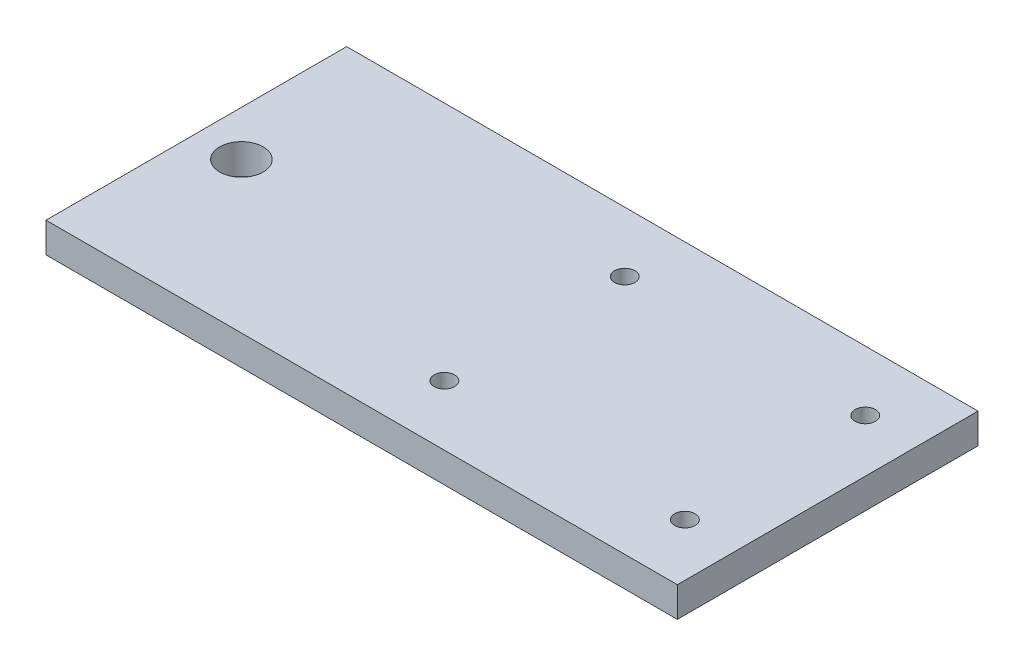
from build123d import *

# Parameters (mm, degrees)
ESQUISSE1_W             = 100
ESQUISSE1_H             = 10
EXTRUSION1_DEPTH        = 105
ESQUISSE2_R             = 7.25
ENL_V_MAT_EXTRU_1_DEPTH = 210
TROU_TARAUD_M8X1_251_D  = 6.8


with BuildPart() as part:
    # Esquisse1 → Extrusion1 (new, symmetric)
    with BuildSketch(Plane(origin=(0, 0, 0), x_dir=(0, 0, -1), z_dir=(1, 0, 0))):
        with Locations((0, -5)):
            Rectangle(ESQUISSE1_W, ESQUISSE1_H)
    extrude(amount=EXTRUSION1_DEPTH, both=True)

    # Esquisse2 → Enl_v. mat.-Extru.1 (cut)
    with BuildSketch(Plane(origin=(0, 0, 0), x_dir=(-1, 0, 0), z_dir=(0, 1, 0))):
        with Locations(Location((90, 0, 0), (0, 0, 90))):
            Circle(ESQUISSE2_R)
    extrude(amount=-ENL_V_MAT_EXTRU_1_DEPTH, mode=Mode.SUBTRACT)

    # Trou taraud_ M8x1.251 (through all)
    with Locations(Plane(origin=(0, 0, 0), x_dir=(-1, 0, 0), z_dir=(0, 1, 0))):
        with Locations((-7.5, 30), (-7.5, -30), (-87.5, -30), (-87.5, 30)):
            Hole(TROU_TARAUD_M8X1_251_D / 2)


solid = part.part
